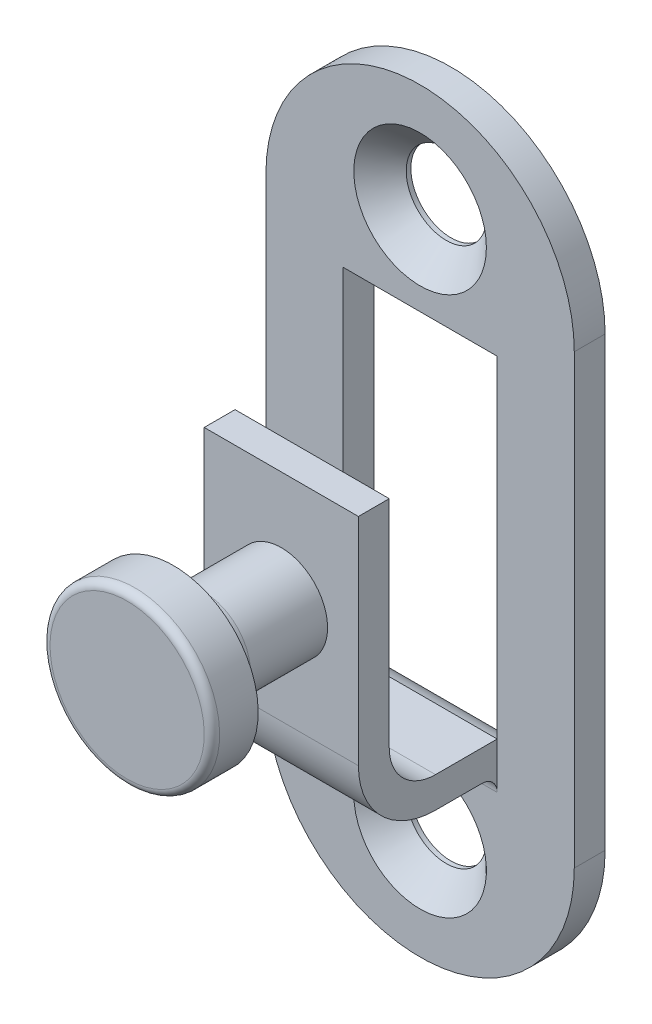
from build123d import *

# Parameters (mm, degrees)
SKETCH_1_W           = 10
SKETCH_1_H           = 23.5
EXTRUDE_1_DEPTH      = 2
EXTRUDE_2_DEPTH      = 5
EXTRUDE_2_DEPTH_BACK = 5


with BuildPart() as part:
    # Sketch 1 → Extrude 1 (new body)
    with BuildSketch(Plane.XY):
        with BuildLine():
            Line((10, -14.5), (10, 14.5))
            ThreePointArc((10, 14.5), (0, 24.5), (-10, 14.5))
            Line((-10, 14.5), (-10, -14.5))
            ThreePointArc((-10, -14.5), (0, -24.5), (10, -14.5))
        make_face()
        Rectangle(SKETCH_1_W, SKETCH_1_H, mode=Mode.SUBTRACT)
    extrude(amount=EXTRUDE_1_DEPTH)

    # Sketch 4 → Extrude 2 (add, two sides: drawn at the far end of the back side and taken through both)
    with BuildSketch(Plane(origin=(0, 0, 0), x_dir=(0, 0, -1), z_dir=(1, 0, 0)).offset(-EXTRUDE_2_DEPTH_BACK)):
        with BuildLine():
            Line((-11, 7.25), (-11, -6.75))
            ThreePointArc((-11, -6.75), (-9.535533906, -10.285533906), (-6, -11.75))
            Line((-6, -11.75), (-3, -11.75))
            ThreePointArc((-3, -11.75), (-2.292893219, -12.042893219), (-2, -12.75))
            Line((-2, -12.75), (-2, -13.75))
            Line((-2, -13.75), (0, -13.75))
            Line((0, -13.75), (0, -11.75))
            ThreePointArc((0, -11.75), (-0.74950835, -10.49950835), (-2, -9.75))
            Line((-2, -9.75), (-6, -9.75))
            ThreePointArc((-6, -9.75), (-8.121320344, -8.871320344), (-9, -6.75))
            Line((-9, -6.75), (-9, 7.25))
            Line((-9, 7.25), (-11, 7.25))
        make_face()
    extrude(amount=EXTRUDE_2_DEPTH + EXTRUDE_2_DEPTH_BACK)

    # Sketch 2 → Cut-Revolve 1 (revolve, cut)
    with BuildSketch(Plane(origin=(0, 0, 0), x_dir=(0, 0, -1), z_dir=(1, 0, 0)), mode=Mode.PRIVATE) as cut_revolve_1_sk:
        Polygon((-2, 17.5), (-2, 21.8), (-0.3, 20.1), (0, 20.1), (0, 17.5), align=None)
    revolve(cut_revolve_1_sk.sketch.rotate(Axis((0, 17.5, 0), (0, 0, 1)), 270), axis=Axis((0, 17.5, 0), (0, 0, 1)), mode=Mode.SUBTRACT)

    # Sketch 3 → Cut-Revolve 2 (revolve, cut)
    with BuildSketch(Plane(origin=(0, 0, 0), x_dir=(0, 0, -1), z_dir=(1, 0, 0)), mode=Mode.PRIVATE) as cut_revolve_2_sk:
        Polygon((0, -17.5), (0, -20.1), (-0.3, -20.1), (-2, -21.8), (-2, -17.5), align=None)
    revolve(cut_revolve_2_sk.sketch.rotate(Axis((0, -17.5, 2), (0, 0, -1)), 90), axis=Axis((0, -17.5, 2), (0, 0, -1)), mode=Mode.SUBTRACT)

    # Sketch 5 → Cut-Revolve 3 (revolve, cut)
    with BuildSketch(Plane(origin=(0, 0, 0), x_dir=(0, 0, -1), z_dir=(1, 0, 0)), mode=Mode.PRIVATE) as cut_revolve_3_sk:
        Polygon((-11, 0), (-11, 3), (-10.4585, 2.4585), (-9.5415, 2.4585), (-9, 3), (-9, 0), align=None)
    revolve(cut_revolve_3_sk.sketch.rotate(Axis((0, 0, 9), (0, 0, 1)), 180), axis=Axis((0, 0, 9), (0, 0, 1)), mode=Mode.SUBTRACT)

    # Sketch 6 → Revolve 1 (revolve)
    with BuildSketch(Plane(origin=(0, 0, 0), x_dir=(0, 0, -1), z_dir=(1, 0, 0)), mode=Mode.PRIVATE) as revolve_1_sk:
        with BuildLine():
            Line((-21, 0), (-21, 5))
            ThreePointArc((-21, 5), (-20.853553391, 5.353553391), (-20.5, 5.5))
            Line((-20.5, 5.5), (-18, 5.5))
            Line((-18, 5.5), (-18, 3.2))
            Line((-18, 3.2), (-16, 3))
            Line((-16, 3), (-9.6135, 3))
            Line((-9.6135, 3), (-9, 2.3865))
            Line((-9, 2.3865), (-9, 0))
            Line((-9, 0), (-21, 0))
        make_face()
    revolve(revolve_1_sk.sketch.rotate(Axis((0, 0, 9), (0, 0, 1)), 180), axis=Axis((0, 0, 9), (0, 0, 1)))


solid = part.part
